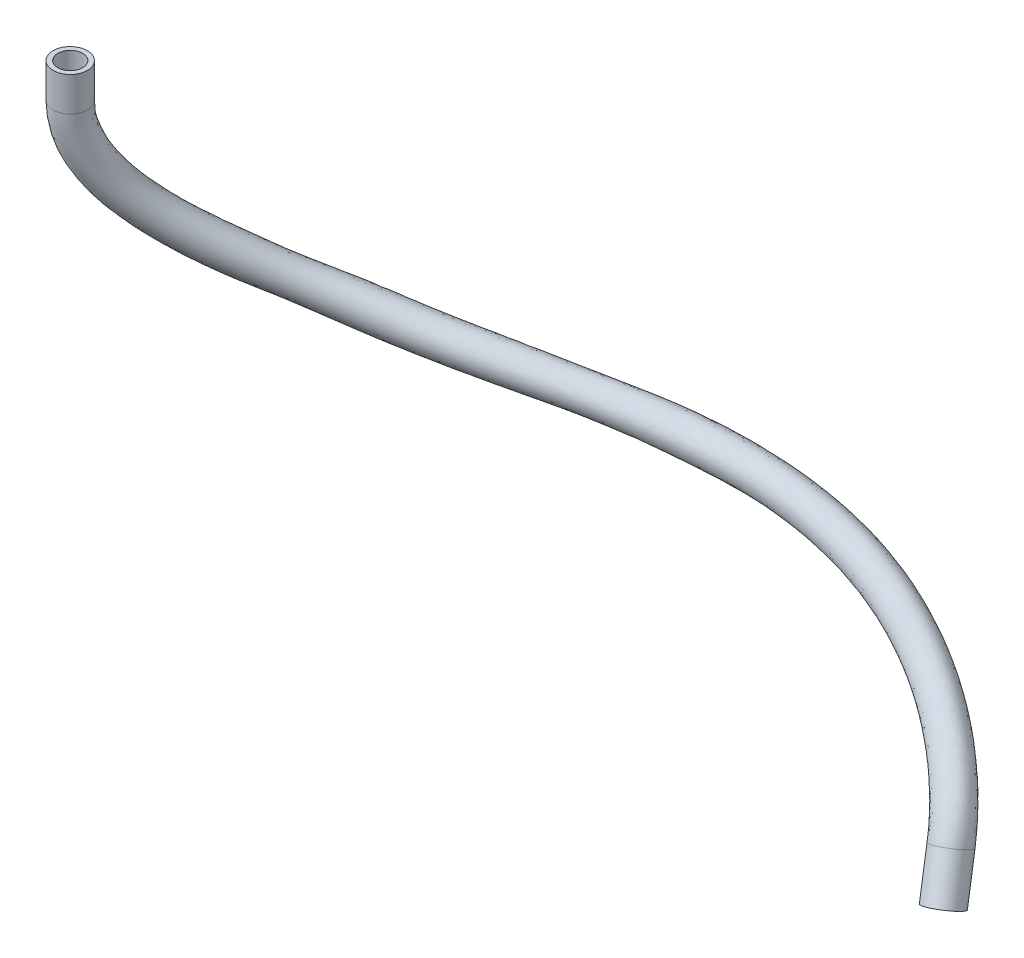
ISO-10303-21;
HEADER;
FILE_DESCRIPTION(('STEP AP214'),'2;1');
FILE_NAME('part.step','',(''),(''),'','','');
FILE_SCHEMA(('AUTOMOTIVE_DESIGN { 1 0 10303 214 1 1 1 1 }'));
ENDSEC;
DATA;
#1=APPLICATION_CONTEXT('core data for automotive mechanical design processes');
#2=APPLICATION_PROTOCOL_DEFINITION('international standard','automotive_design',2000,#1);
#3=PRODUCT_CONTEXT('',#1,'mechanical');
#4=PRODUCT('Part','Part','',(#3));
#5=PRODUCT_RELATED_PRODUCT_CATEGORY('part','',(#4));
#6=PRODUCT_DEFINITION_FORMATION('','',#4);
#7=PRODUCT_DEFINITION_CONTEXT('part definition',#1,'design');
#8=PRODUCT_DEFINITION('design','',#6,#7);
#9=PRODUCT_DEFINITION_SHAPE('','',#8);
#10=(LENGTH_UNIT() NAMED_UNIT(*) SI_UNIT(.MILLI.,.METRE.));
#11=(NAMED_UNIT(*) PLANE_ANGLE_UNIT() SI_UNIT($,.RADIAN.));
#12=(NAMED_UNIT(*) SI_UNIT($,.STERADIAN.) SOLID_ANGLE_UNIT());
#13=UNCERTAINTY_MEASURE_WITH_UNIT(LENGTH_MEASURE(1.E-05),#10,'distance_accuracy_value','');
#14=(GEOMETRIC_REPRESENTATION_CONTEXT(3) GLOBAL_UNCERTAINTY_ASSIGNED_CONTEXT((#13)) GLOBAL_UNIT_ASSIGNED_CONTEXT((#10,
#11,#12)) REPRESENTATION_CONTEXT('',''));
#15=CARTESIAN_POINT('',(0.,0.,0.));
#16=DIRECTION('',(0.,0.,1.));
#17=DIRECTION('',(1.,0.,0.));
#18=AXIS2_PLACEMENT_3D('',#15,#16,#17);
#19=CARTESIAN_POINT('',(148.914995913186,-93.9022089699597,-18.4763685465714));
#20=DIRECTION('',(0.240157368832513,-0.878268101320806,0.413484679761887));
#21=DIRECTION('',(0.,-0.425950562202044,-0.904746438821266));
#22=AXIS2_PLACEMENT_3D('',#19,#20,#21);
#23=CYLINDRICAL_SURFACE('',#22,2.75);
#24=CARTESIAN_POINT('',(148.914995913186,-93.9022089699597,-18.4763685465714));
#25=DIRECTION('',(0.240157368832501,-0.878268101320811,0.413484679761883));
#26=DIRECTION('',(-0.0483571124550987,-0.43624560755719,-0.898527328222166));
#27=AXIS2_PLACEMENT_3D('',#24,#25,#26);
#28=CIRCLE('',#27,2.75);
#29=CARTESIAN_POINT('',(148.914995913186,-95.0735730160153,-20.9644212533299));
#30=VERTEX_POINT('',#29);
#31=EDGE_CURVE('E96',#30,#30,#28,.T.);
#32=CARTESIAN_POINT('',(150.624157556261,-100.152702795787,-15.5336641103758));
#33=DIRECTION('',(0.240157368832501,-0.878268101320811,0.413484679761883));
#34=DIRECTION('',(-0.0483571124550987,-0.43624560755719,-0.898527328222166));
#35=AXIS2_PLACEMENT_3D('',#32,#33,#34);
#36=CIRCLE('',#35,2.75);
#37=CARTESIAN_POINT('',(150.624157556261,-101.324066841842,-18.0217168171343));
#38=VERTEX_POINT('',#37);
#39=EDGE_CURVE('E11',#38,#38,#36,.T.);
#40=CARTESIAN_POINT('',(148.914995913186,-95.0735730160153,-20.9644212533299));
#41=CARTESIAN_POINT('',(148.932799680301,-95.138682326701,-20.9337680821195));
#42=CARTESIAN_POINT('',(148.950603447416,-95.2037916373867,-20.9031149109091));
#43=CARTESIAN_POINT('',(148.986210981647,-95.3340102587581,-20.8418085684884));
#44=CARTESIAN_POINT('',(149.004014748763,-95.3991195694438,-20.811155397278));
#45=CARTESIAN_POINT('',(149.039622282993,-95.5293381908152,-20.7498490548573));
#46=CARTESIAN_POINT('',(149.057426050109,-95.5944475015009,-20.7191958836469));
#47=CARTESIAN_POINT('',(149.093033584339,-95.7246661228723,-20.6578895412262));
#48=CARTESIAN_POINT('',(149.110837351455,-95.789775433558,-20.6272363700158));
#49=CARTESIAN_POINT('',(149.146444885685,-95.9199940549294,-20.5659300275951));
#50=CARTESIAN_POINT('',(149.164248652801,-95.9851033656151,-20.5352768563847));
#51=CARTESIAN_POINT('',(149.199856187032,-96.1153219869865,-20.4739705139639));
#52=CARTESIAN_POINT('',(149.217659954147,-96.1804312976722,-20.4433173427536));
#53=CARTESIAN_POINT('',(149.253267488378,-96.3106499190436,-20.3820110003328));
#54=CARTESIAN_POINT('',(149.271071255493,-96.3757592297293,-20.3513578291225));
#55=CARTESIAN_POINT('',(149.306678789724,-96.5059778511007,-20.2900514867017));
#56=CARTESIAN_POINT('',(149.324482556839,-96.5710871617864,-20.2593983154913));
#57=CARTESIAN_POINT('',(149.36009009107,-96.7013057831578,-20.1980919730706));
#58=CARTESIAN_POINT('',(149.377893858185,-96.7664150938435,-20.1674388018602));
#59=CARTESIAN_POINT('',(149.413501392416,-96.8966337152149,-20.1061324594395));
#60=CARTESIAN_POINT('',(149.431305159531,-96.9617430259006,-20.0754792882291));
#61=CARTESIAN_POINT('',(149.466912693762,-97.091961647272,-20.0141729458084));
#62=CARTESIAN_POINT('',(149.484716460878,-97.1570709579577,-19.983519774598));
#63=CARTESIAN_POINT('',(149.520323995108,-97.2872895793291,-19.9222134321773));
#64=CARTESIAN_POINT('',(149.538127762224,-97.3523988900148,-19.8915602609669));
#65=CARTESIAN_POINT('',(149.573735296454,-97.4826175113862,-19.8302539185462));
#66=CARTESIAN_POINT('',(149.59153906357,-97.5477268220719,-19.7996007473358));
#67=CARTESIAN_POINT('',(149.627146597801,-97.6779454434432,-19.7382944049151));
#68=CARTESIAN_POINT('',(149.644950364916,-97.743054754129,-19.7076412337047));
#69=CARTESIAN_POINT('',(149.680557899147,-97.8732733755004,-19.6463348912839));
#70=CARTESIAN_POINT('',(149.698361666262,-97.9383826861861,-19.6156817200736));
#71=CARTESIAN_POINT('',(149.733969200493,-98.0686013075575,-19.5543753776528));
#72=CARTESIAN_POINT('',(149.751772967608,-98.1337106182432,-19.5237222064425));
#73=CARTESIAN_POINT('',(149.787380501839,-98.2639292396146,-19.4624158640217));
#74=CARTESIAN_POINT('',(149.805184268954,-98.3290385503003,-19.4317626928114));
#75=CARTESIAN_POINT('',(149.840791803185,-98.4592571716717,-19.3704563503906));
#76=CARTESIAN_POINT('',(149.8585955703,-98.5243664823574,-19.3398031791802));
#77=CARTESIAN_POINT('',(149.894203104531,-98.6545851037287,-19.2784968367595));
#78=CARTESIAN_POINT('',(149.912006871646,-98.7196944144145,-19.2478436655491));
#79=CARTESIAN_POINT('',(149.947614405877,-98.8499130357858,-19.1865373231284));
#80=CARTESIAN_POINT('',(149.965418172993,-98.9150223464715,-19.155884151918));
#81=CARTESIAN_POINT('',(150.001025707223,-99.0452409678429,-19.0945778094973));
#82=CARTESIAN_POINT('',(150.018829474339,-99.1103502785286,-19.0639246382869));
#83=CARTESIAN_POINT('',(150.054437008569,-99.2405688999,-19.0026182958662));
#84=CARTESIAN_POINT('',(150.072240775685,-99.3056782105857,-18.9719651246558));
#85=CARTESIAN_POINT('',(150.107848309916,-99.4358968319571,-18.9106587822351));
#86=CARTESIAN_POINT('',(150.125652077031,-99.5010061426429,-18.8800056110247));
#87=CARTESIAN_POINT('',(150.161259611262,-99.6312247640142,-18.8186992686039));
#88=CARTESIAN_POINT('',(150.179063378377,-99.6963340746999,-18.7880460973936));
#89=CARTESIAN_POINT('',(150.214670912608,-99.8265526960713,-18.7267397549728));
#90=CARTESIAN_POINT('',(150.232474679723,-99.891662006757,-18.6960865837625));
#91=CARTESIAN_POINT('',(150.268082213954,-100.021880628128,-18.6347802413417));
#92=CARTESIAN_POINT('',(150.285885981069,-100.086989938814,-18.6041270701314));
#93=CARTESIAN_POINT('',(150.3214935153,-100.217208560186,-18.5428207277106));
#94=CARTESIAN_POINT('',(150.339297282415,-100.282317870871,-18.5121675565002));
#95=CARTESIAN_POINT('',(150.374904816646,-100.412536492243,-18.4508612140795));
#96=CARTESIAN_POINT('',(150.392708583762,-100.477645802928,-18.4202080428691));
#97=CARTESIAN_POINT('',(150.428316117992,-100.6078644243,-18.3589017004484));
#98=CARTESIAN_POINT('',(150.446119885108,-100.672973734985,-18.328248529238));
#99=CARTESIAN_POINT('',(150.481727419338,-100.803192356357,-18.2669421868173));
#100=CARTESIAN_POINT('',(150.499531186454,-100.868301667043,-18.2362890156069));
#101=CARTESIAN_POINT('',(150.535138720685,-100.998520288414,-18.1749826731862));
#102=CARTESIAN_POINT('',(150.5529424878,-101.0636295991,-18.1443295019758));
#103=CARTESIAN_POINT('',(150.588550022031,-101.193848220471,-18.0830231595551));
#104=CARTESIAN_POINT('',(150.606353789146,-101.258957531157,-18.0523699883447));
#105=CARTESIAN_POINT('',(150.624157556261,-101.324066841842,-18.0217168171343));
#106=B_SPLINE_CURVE_WITH_KNOTS('',3,(#40,#41,#42,#43,#44,#45,#46,#47,#48,#49,#50,#51,#52,#53,
#54,#55,#56,#57,#58,#59,#60,#61,#62,#63,#64,#65,#66,#67,#68,#69,#70,#71,#72,#73,#74,#75,#76,#77,
#78,#79,#80,#81,#82,#83,#84,#85,#86,#87,#88,#89,#90,#91,#92,#93,#94,#95,#96,#97,#98,#99,#100,
#101,#102,#103,#104,#105),.UNSPECIFIED.,.F.,.F.,(4,2,2,2,2,2,2,2,2,2,2,2,2,2,2,2,2,2,2,2,2,2,2,
2,2,2,2,2,2,2,2,2,4),(0.,0.222401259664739,0.444802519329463,0.66720377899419,0.889605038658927,
1.11200629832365,1.33440755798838,1.5568088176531,1.77921007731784,2.00161133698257,
2.22401259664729,2.44641385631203,2.66881511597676,2.89121637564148,3.11361763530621,
3.33601889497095,3.55842015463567,3.7808214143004,4.00322267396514,4.22562393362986,
4.44802519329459,4.67042645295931,4.89282771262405,5.11522897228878,5.3376302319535,
5.56003149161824,5.78243275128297,6.00483401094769,6.22723527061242,6.44963653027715,
6.67203778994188,6.89443904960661,7.11684030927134),.UNSPECIFIED.);
#107=EDGE_CURVE('BSEAM73',#30,#38,#106,.T.);
#108=ORIENTED_EDGE('',*,*,#31,.T.);
#109=ORIENTED_EDGE('',*,*,#39,.F.);
#110=ORIENTED_EDGE('',*,*,#107,.T.);
#111=ORIENTED_EDGE('',*,*,#107,.F.);
#112=EDGE_LOOP('',(#108,#110,#109,#111));
#113=FACE_BOUND('',#112,.T.);
#114=ADVANCED_FACE('F73',(#113),#23,.T.);
#115=CARTESIAN_POINT('',(148.914995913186,-93.9022089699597,-18.4763685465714));
#116=DIRECTION('',(0.240157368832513,-0.878268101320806,0.413484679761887));
#117=DIRECTION('',(0.,-0.425950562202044,-0.904746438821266));
#118=AXIS2_PLACEMENT_3D('',#115,#116,#117);
#119=CYLINDRICAL_SURFACE('',#118,2.);
#120=CARTESIAN_POINT('',(148.914995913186,-93.9022089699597,-18.4763685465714));
#121=DIRECTION('',(0.240157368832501,-0.878268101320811,0.413484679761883));
#122=DIRECTION('',(-0.0483571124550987,-0.43624560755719,-0.898527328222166));
#123=AXIS2_PLACEMENT_3D('',#120,#121,#122);
#124=CIRCLE('',#123,2.);
#125=CARTESIAN_POINT('',(148.914995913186,-94.7541100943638,-20.2858614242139));
#126=VERTEX_POINT('',#125);
#127=EDGE_CURVE('E99',#126,#126,#124,.T.);
#128=CARTESIAN_POINT('',(150.624157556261,-100.152702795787,-15.5336641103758));
#129=DIRECTION('',(0.240157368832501,-0.878268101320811,0.413484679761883));
#130=DIRECTION('',(-0.0483571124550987,-0.43624560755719,-0.898527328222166));
#131=AXIS2_PLACEMENT_3D('',#128,#129,#130);
#132=CIRCLE('',#131,2.);
#133=CARTESIAN_POINT('',(150.624157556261,-101.004603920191,-17.3431569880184));
#134=VERTEX_POINT('',#133);
#135=EDGE_CURVE('E79',#134,#134,#132,.T.);
#136=CARTESIAN_POINT('',(148.914995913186,-94.7541100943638,-20.2858614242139));
#137=CARTESIAN_POINT('',(148.932799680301,-94.8192194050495,-20.2552082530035));
#138=CARTESIAN_POINT('',(148.950603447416,-94.8843287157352,-20.2245550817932));
#139=CARTESIAN_POINT('',(148.986210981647,-95.0145473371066,-20.1632487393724));
#140=CARTESIAN_POINT('',(149.004014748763,-95.0796566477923,-20.1325955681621));
#141=CARTESIAN_POINT('',(149.039622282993,-95.2098752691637,-20.0712892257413));
#142=CARTESIAN_POINT('',(149.057426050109,-95.2749845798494,-20.0406360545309));
#143=CARTESIAN_POINT('',(149.093033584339,-95.4052032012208,-19.9793297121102));
#144=CARTESIAN_POINT('',(149.110837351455,-95.4703125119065,-19.9486765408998));
#145=CARTESIAN_POINT('',(149.146444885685,-95.6005311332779,-19.8873701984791));
#146=CARTESIAN_POINT('',(149.164248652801,-95.6656404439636,-19.8567170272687));
#147=CARTESIAN_POINT('',(149.199856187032,-95.795859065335,-19.795410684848));
#148=CARTESIAN_POINT('',(149.217659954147,-95.8609683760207,-19.7647575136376));
#149=CARTESIAN_POINT('',(149.253267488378,-95.991186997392,-19.7034511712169));
#150=CARTESIAN_POINT('',(149.271071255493,-96.0562963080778,-19.6727980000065));
#151=CARTESIAN_POINT('',(149.306678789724,-96.1865149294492,-19.6114916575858));
#152=CARTESIAN_POINT('',(149.324482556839,-96.2516242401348,-19.5808384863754));
#153=CARTESIAN_POINT('',(149.36009009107,-96.3818428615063,-19.5195321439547));
#154=CARTESIAN_POINT('',(149.377893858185,-96.446952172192,-19.4888789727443));
#155=CARTESIAN_POINT('',(149.413501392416,-96.5771707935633,-19.4275726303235));
#156=CARTESIAN_POINT('',(149.431305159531,-96.6422801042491,-19.3969194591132));
#157=CARTESIAN_POINT('',(149.466912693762,-96.7724987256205,-19.3356131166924));
#158=CARTESIAN_POINT('',(149.484716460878,-96.8376080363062,-19.3049599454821));
#159=CARTESIAN_POINT('',(149.520323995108,-96.9678266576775,-19.2436536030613));
#160=CARTESIAN_POINT('',(149.538127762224,-97.0329359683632,-19.213000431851));
#161=CARTESIAN_POINT('',(149.573735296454,-97.1631545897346,-19.1516940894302));
#162=CARTESIAN_POINT('',(149.59153906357,-97.2282639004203,-19.1210409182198));
#163=CARTESIAN_POINT('',(149.627146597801,-97.3584825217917,-19.0597345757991));
#164=CARTESIAN_POINT('',(149.644950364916,-97.4235918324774,-19.0290814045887));
#165=CARTESIAN_POINT('',(149.680557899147,-97.5538104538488,-18.967775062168));
#166=CARTESIAN_POINT('',(149.698361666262,-97.6189197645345,-18.9371218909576));
#167=CARTESIAN_POINT('',(149.733969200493,-97.7491383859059,-18.8758155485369));
#168=CARTESIAN_POINT('',(149.751772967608,-97.8142476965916,-18.8451623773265));
#169=CARTESIAN_POINT('',(149.787380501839,-97.944466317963,-18.7838560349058));
#170=CARTESIAN_POINT('',(149.805184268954,-98.0095756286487,-18.7532028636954));
#171=CARTESIAN_POINT('',(149.840791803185,-98.1397942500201,-18.6918965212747));
#172=CARTESIAN_POINT('',(149.8585955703,-98.2049035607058,-18.6612433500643));
#173=CARTESIAN_POINT('',(149.894203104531,-98.3351221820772,-18.5999370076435));
#174=CARTESIAN_POINT('',(149.912006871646,-98.4002314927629,-18.5692838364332));
#175=CARTESIAN_POINT('',(149.947614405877,-98.5304501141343,-18.5079774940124));
#176=CARTESIAN_POINT('',(149.965418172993,-98.59555942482,-18.4773243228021));
#177=CARTESIAN_POINT('',(150.001025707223,-98.7257780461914,-18.4160179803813));
#178=CARTESIAN_POINT('',(150.018829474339,-98.7908873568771,-18.385364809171));
#179=CARTESIAN_POINT('',(150.054437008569,-98.9211059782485,-18.3240584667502));
#180=CARTESIAN_POINT('',(150.072240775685,-98.9862152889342,-18.2934052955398));
#181=CARTESIAN_POINT('',(150.107848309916,-99.1164339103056,-18.2320989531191));
#182=CARTESIAN_POINT('',(150.125652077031,-99.1815432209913,-18.2014457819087));
#183=CARTESIAN_POINT('',(150.161259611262,-99.3117618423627,-18.140139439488));
#184=CARTESIAN_POINT('',(150.179063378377,-99.3768711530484,-18.1094862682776));
#185=CARTESIAN_POINT('',(150.214670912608,-99.5070897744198,-18.0481799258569));
#186=CARTESIAN_POINT('',(150.232474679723,-99.5721990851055,-18.0175267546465));
#187=CARTESIAN_POINT('',(150.268082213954,-99.7024177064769,-17.9562204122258));
#188=CARTESIAN_POINT('',(150.285885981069,-99.7675270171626,-17.9255672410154));
#189=CARTESIAN_POINT('',(150.3214935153,-99.897745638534,-17.8642608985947));
#190=CARTESIAN_POINT('',(150.339297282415,-99.9628549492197,-17.8336077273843));
#191=CARTESIAN_POINT('',(150.374904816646,-100.093073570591,-17.7723013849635));
#192=CARTESIAN_POINT('',(150.392708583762,-100.158182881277,-17.7416482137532));
#193=CARTESIAN_POINT('',(150.428316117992,-100.288401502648,-17.6803418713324));
#194=CARTESIAN_POINT('',(150.446119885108,-100.353510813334,-17.6496887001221));
#195=CARTESIAN_POINT('',(150.481727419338,-100.483729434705,-17.5883823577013));
#196=CARTESIAN_POINT('',(150.499531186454,-100.548838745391,-17.557729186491));
#197=CARTESIAN_POINT('',(150.535138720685,-100.679057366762,-17.4964228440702));
#198=CARTESIAN_POINT('',(150.5529424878,-100.744166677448,-17.4657696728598));
#199=CARTESIAN_POINT('',(150.588550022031,-100.874385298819,-17.4044633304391));
#200=CARTESIAN_POINT('',(150.606353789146,-100.939494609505,-17.3738101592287));
#201=CARTESIAN_POINT('',(150.624157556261,-101.004603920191,-17.3431569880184));
#202=B_SPLINE_CURVE_WITH_KNOTS('',3,(#136,#137,#138,#139,#140,#141,#142,#143,#144,#145,#146,
#147,#148,#149,#150,#151,#152,#153,#154,#155,#156,#157,#158,#159,#160,#161,#162,#163,#164,#165,
#166,#167,#168,#169,#170,#171,#172,#173,#174,#175,#176,#177,#178,#179,#180,#181,#182,#183,#184,
#185,#186,#187,#188,#189,#190,#191,#192,#193,#194,#195,#196,#197,#198,#199,#200,#201),
.UNSPECIFIED.,.F.,.F.,(4,2,2,2,2,2,2,2,2,2,2,2,2,2,2,2,2,2,2,2,2,2,2,2,2,2,2,2,2,2,2,2,4),(0.,
0.222401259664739,0.444802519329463,0.66720377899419,0.889605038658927,1.11200629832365,
1.33440755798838,1.5568088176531,1.77921007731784,2.00161133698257,2.22401259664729,
2.44641385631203,2.66881511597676,2.89121637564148,3.11361763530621,3.33601889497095,
3.55842015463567,3.7808214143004,4.00322267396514,4.22562393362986,4.44802519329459,
4.67042645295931,4.89282771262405,5.11522897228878,5.3376302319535,5.56003149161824,
5.78243275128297,6.00483401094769,6.22723527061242,6.44963653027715,6.67203778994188,
6.89443904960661,7.11684030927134),.UNSPECIFIED.);
#203=EDGE_CURVE('BSEAM115',#126,#134,#202,.T.);
#204=ORIENTED_EDGE('',*,*,#127,.F.);
#205=ORIENTED_EDGE('',*,*,#135,.T.);
#206=ORIENTED_EDGE('',*,*,#203,.T.);
#207=ORIENTED_EDGE('',*,*,#203,.F.);
#208=EDGE_LOOP('',(#204,#206,#205,#207));
#209=FACE_BOUND('',#208,.T.);
#210=ADVANCED_FACE('F115',(#209),#119,.F.);
#211=CARTESIAN_POINT('',(26.,-42.4999957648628,0.));
#212=DIRECTION('',(0.,1.,0.));
#213=DIRECTION('',(-1.,0.,0.));
#214=AXIS2_PLACEMENT_3D('',#211,#212,#213);
#215=CYLINDRICAL_SURFACE('',#214,2.);
#216=CARTESIAN_POINT('',(26.,-42.4999957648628,0.));
#217=DIRECTION('',(0.,-1.,0.));
#218=DIRECTION('',(1.,0.,0.));
#219=AXIS2_PLACEMENT_3D('',#216,#217,#218);
#220=CIRCLE('',#219,2.);
#221=CARTESIAN_POINT('',(28.,-42.4999957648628,0.));
#222=VERTEX_POINT('',#221);
#223=EDGE_CURVE('E94',#222,#222,#220,.T.);
#224=ORIENTED_EDGE('',*,*,#223,.T.);
#225=EDGE_LOOP('',(#224));
#226=FACE_BOUND('',#225,.T.);
#227=CARTESIAN_POINT('',(26.,-36.999994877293,0.));
#228=DIRECTION('',(0.,-1.,0.));
#229=DIRECTION('',(1.,0.,0.));
#230=AXIS2_PLACEMENT_3D('',#227,#228,#229);
#231=CIRCLE('',#230,2.);
#232=CARTESIAN_POINT('',(28.,-36.999994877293,0.));
#233=VERTEX_POINT('',#232);
#234=EDGE_CURVE('E92',#233,#233,#231,.T.);
#235=ORIENTED_EDGE('',*,*,#234,.F.);
#236=EDGE_LOOP('',(#235));
#237=FACE_BOUND('',#236,.T.);
#238=ADVANCED_FACE('F105',(#226,#237),#215,.F.);
#239=CARTESIAN_POINT('',(26.,-42.4999957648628,0.));
#240=DIRECTION('',(0.,1.,0.));
#241=DIRECTION('',(-1.,0.,0.));
#242=AXIS2_PLACEMENT_3D('',#239,#240,#241);
#243=CYLINDRICAL_SURFACE('',#242,2.75);
#244=CARTESIAN_POINT('',(26.,-42.4999957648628,0.));
#245=DIRECTION('',(0.,-1.,0.));
#246=DIRECTION('',(1.,0.,0.));
#247=AXIS2_PLACEMENT_3D('',#244,#245,#246);
#248=CIRCLE('',#247,2.75);
#249=CARTESIAN_POINT('',(28.75,-42.4999957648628,0.));
#250=VERTEX_POINT('',#249);
#251=EDGE_CURVE('E83',#250,#250,#248,.T.);
#252=ORIENTED_EDGE('',*,*,#251,.F.);
#253=EDGE_LOOP('',(#252));
#254=FACE_BOUND('',#253,.T.);
#255=CARTESIAN_POINT('',(26.,-36.999994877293,0.));
#256=DIRECTION('',(0.,-1.,0.));
#257=DIRECTION('',(1.,0.,0.));
#258=AXIS2_PLACEMENT_3D('',#255,#256,#257);
#259=CIRCLE('',#258,2.75);
#260=CARTESIAN_POINT('',(28.75,-36.999994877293,0.));
#261=VERTEX_POINT('',#260);
#262=EDGE_CURVE('E87',#261,#261,#259,.T.);
#263=ORIENTED_EDGE('',*,*,#262,.T.);
#264=EDGE_LOOP('',(#263));
#265=FACE_BOUND('',#264,.T.);
#266=ADVANCED_FACE('F121',(#254,#265),#243,.T.);
#267=CARTESIAN_POINT('',(26.,-36.999994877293,0.));
#268=DIRECTION('',(0.,-1.,0.));
#269=DIRECTION('',(1.,0.,0.));
#270=AXIS2_PLACEMENT_3D('',#267,#268,#269);
#271=PLANE('',#270);
#272=ORIENTED_EDGE('',*,*,#234,.T.);
#273=EDGE_LOOP('',(#272));
#274=FACE_BOUND('',#273,.T.);
#275=ORIENTED_EDGE('',*,*,#262,.F.);
#276=EDGE_LOOP('',(#275));
#277=FACE_BOUND('',#276,.T.);
#278=ADVANCED_FACE('F127',(#274,#277),#271,.F.);
#279=CARTESIAN_POINT('',(150.624157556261,-100.152702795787,-15.5336641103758));
#280=DIRECTION('',(0.240157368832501,-0.878268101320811,0.413484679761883));
#281=DIRECTION('',(-0.0483571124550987,-0.43624560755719,-0.898527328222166));
#282=AXIS2_PLACEMENT_3D('',#279,#280,#281);
#283=PLANE('',#282);
#284=ORIENTED_EDGE('',*,*,#135,.F.);
#285=EDGE_LOOP('',(#284));
#286=FACE_BOUND('',#285,.T.);
#287=ORIENTED_EDGE('',*,*,#39,.T.);
#288=EDGE_LOOP('',(#287));
#289=FACE_BOUND('',#288,.T.);
#290=ADVANCED_FACE('F131',(#286,#289),#283,.T.);
#291=CARTESIAN_POINT('',(28.75,-42.4999957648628,0.));
#292=CARTESIAN_POINT('',(28.75,-43.7765438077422,0.));
#293=CARTESIAN_POINT('',(28.9352645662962,-45.7354849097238,-0.170747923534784));
#294=CARTESIAN_POINT('',(29.7310391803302,-48.9900951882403,-1.09436596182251));
#295=CARTESIAN_POINT('',(31.0202255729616,-52.0434531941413,-2.54956545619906));
#296=CARTESIAN_POINT('',(32.763046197,-55.0259343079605,-4.4509762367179));
#297=CARTESIAN_POINT('',(35.9509557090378,-59.3269919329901,-7.8071546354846));
#298=CARTESIAN_POINT('',(41.3967733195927,-64.7135614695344,-12.8287855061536));
#299=CARTESIAN_POINT('',(45.9882365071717,-69.2448468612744,-17.4180763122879));
#300=CARTESIAN_POINT('',(51.0763572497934,-72.3779052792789,-21.2929369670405));
#301=CARTESIAN_POINT('',(56.2786946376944,-73.9555459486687,-24.155224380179));
#302=CARTESIAN_POINT('',(67.9719591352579,-75.6612876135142,-29.7866336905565));
#303=CARTESIAN_POINT('',(81.0049746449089,-79.3965853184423,-35.3194808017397));
#304=CARTESIAN_POINT('',(94.2233832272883,-80.2735524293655,-37.4974093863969));
#305=CARTESIAN_POINT('',(103.790336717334,-81.0693937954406,-37.7597690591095));
#306=CARTESIAN_POINT('',(109.589321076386,-81.617930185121,-37.2788331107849));
#307=CARTESIAN_POINT('',(117.447407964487,-82.493511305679,-35.9927433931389));
#308=CARTESIAN_POINT('',(125.222518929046,-83.5790363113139,-33.9649484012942));
#309=CARTESIAN_POINT('',(134.235543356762,-85.5002280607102,-30.6165303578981));
#310=CARTESIAN_POINT('',(140.236293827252,-87.4588067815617,-27.5884699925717));
#311=CARTESIAN_POINT('',(143.980857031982,-89.4255156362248,-25.2029117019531));
#312=CARTESIAN_POINT('',(146.217357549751,-91.0824695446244,-23.5454284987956));
#313=CARTESIAN_POINT('',(147.844284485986,-93.05202188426,-22.0436249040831));
#314=CARTESIAN_POINT('',(148.543197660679,-94.2285210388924,-21.3584942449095));
#315=CARTESIAN_POINT('',(148.782013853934,-95.1018843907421,-20.9473186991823));
#316=CARTESIAN_POINT('',(28.75,-42.4999957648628,-5.49999999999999));
#317=CARTESIAN_POINT('',(28.75,-44.218909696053,-5.49999999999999));
#318=CARTESIAN_POINT('',(29.0008669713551,-44.1791453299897,-5.58242723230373));
#319=CARTESIAN_POINT('',(29.6859951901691,-46.9667238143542,-6.19327835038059));
#320=CARTESIAN_POINT('',(30.9034523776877,-49.1735577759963,-7.27423746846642));
#321=CARTESIAN_POINT('',(32.6657099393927,-51.6319915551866,-8.79280866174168));
#322=CARTESIAN_POINT('',(36.0897364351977,-55.2392896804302,-11.5162648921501));
#323=CARTESIAN_POINT('',(42.6908702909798,-59.5074784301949,-15.5069213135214));
#324=CARTESIAN_POINT('',(48.6753456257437,-64.5629775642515,-17.2225621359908));
#325=CARTESIAN_POINT('',(54.0999734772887,-67.7520301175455,-19.9043706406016));
#326=CARTESIAN_POINT('',(58.6148348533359,-68.9432500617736,-23.2395708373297));
#327=CARTESIAN_POINT('',(68.3990962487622,-69.9450329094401,-30.3689470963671));
#328=CARTESIAN_POINT('',(82.5508743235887,-75.2070884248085,-31.4861463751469));
#329=CARTESIAN_POINT('',(94.7790076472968,-76.6796190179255,-33.311435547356));
#330=CARTESIAN_POINT('',(103.626694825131,-78.1391033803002,-33.1324729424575));
#331=CARTESIAN_POINT('',(108.987476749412,-79.1746558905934,-32.3736793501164));
#332=CARTESIAN_POINT('',(116.218448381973,-80.800621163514,-30.854240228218));
#333=CARTESIAN_POINT('',(123.321730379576,-82.7807385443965,-28.7778105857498));
#334=CARTESIAN_POINT('',(131.436363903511,-86.3172106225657,-25.8228985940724));
#335=CARTESIAN_POINT('',(136.763976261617,-89.3022165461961,-23.6836391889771));
#336=CARTESIAN_POINT('',(139.955742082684,-91.6613170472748,-22.1376326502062));
#337=CARTESIAN_POINT('',(141.703304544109,-93.2070512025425,-21.2557708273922));
#338=CARTESIAN_POINT('',(142.970625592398,-95.22742666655,-20.2756548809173));
#339=CARTESIAN_POINT('',(143.110021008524,-94.9368672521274,-20.7221800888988));
#340=CARTESIAN_POINT('',(143.449605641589,-96.1787460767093,-20.137509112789));
#341=CARTESIAN_POINT('',(23.25,-42.4999957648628,-5.49999999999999));
#342=CARTESIAN_POINT('',(23.25,-44.218909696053,-5.49999999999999));
#343=CARTESIAN_POINT('',(23.5551688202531,-45.2217901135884,-5.78497064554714));
#344=CARTESIAN_POINT('',(24.4311653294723,-48.50384112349,-6.76385218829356));
#345=CARTESIAN_POINT('',(25.868516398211,-51.16482773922,-8.3159762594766));
#346=CARTESIAN_POINT('',(27.829926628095,-53.7721235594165,-10.3466771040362));
#347=CARTESIAN_POINT('',(31.5411330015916,-57.2705418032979,-13.8809190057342));
#348=CARTESIAN_POINT('',(38.3322222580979,-60.4932562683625,-19.4956545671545));
#349=CARTESIAN_POINT('',(45.9897558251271,-62.8510330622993,-21.5875756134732));
#350=CARTESIAN_POINT('',(52.238551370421,-65.1298004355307,-24.6110017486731));
#351=CARTESIAN_POINT('',(56.7179938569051,-67.1574054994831,-28.2258113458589));
#352=CARTESIAN_POINT('',(65.9359885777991,-70.2994549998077,-35.4931567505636));
#353=CARTESIAN_POINT('',(81.9269017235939,-71.1638293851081,-35.7376109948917));
#354=CARTESIAN_POINT('',(94.7859578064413,-72.4919642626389,-36.9369295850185));
#355=CARTESIAN_POINT('',(104.11958917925,-73.5333921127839,-36.038858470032));
#356=CARTESIAN_POINT('',(109.749384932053,-74.2560862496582,-34.7386766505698));
#357=CARTESIAN_POINT('',(117.238178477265,-75.5568570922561,-32.3521167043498));
#358=CARTESIAN_POINT('',(124.453794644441,-77.3386100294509,-29.2196207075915));
#359=CARTESIAN_POINT('',(132.277964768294,-80.9500861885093,-24.4455735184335));
#360=CARTESIAN_POINT('',(137.223255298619,-84.4712809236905,-21.0155879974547));
#361=CARTESIAN_POINT('',(140.246499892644,-87.3678839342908,-18.6808561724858));
#362=CARTESIAN_POINT('',(141.948542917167,-89.4428183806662,-17.2469266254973));
#363=CARTESIAN_POINT('',(143.251681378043,-91.8957099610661,-15.8489429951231));
#364=CARTESIAN_POINT('',(143.375985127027,-92.5375164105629,-15.7802797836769));
#365=CARTESIAN_POINT('',(143.715569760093,-93.7793952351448,-15.1956088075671));
#366=CARTESIAN_POINT('',(23.25,-42.4999957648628,0.));
#367=CARTESIAN_POINT('',(23.25,-43.9977267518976,0.));
#368=CARTESIAN_POINT('',(23.4895664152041,-46.6754795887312,-0.373291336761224));
#369=CARTESIAN_POINT('',(24.4762093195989,-50.5547134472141,-1.66493979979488));
#370=CARTESIAN_POINT('',(25.985289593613,-54.0273694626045,-3.59130424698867));
#371=CARTESIAN_POINT('',(27.9272628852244,-57.1679801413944,-6.00484467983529));
#372=CARTESIAN_POINT('',(31.4023522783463,-61.3568347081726,-10.1718087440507));
#373=CARTESIAN_POINT('',(37.0381252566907,-65.6998331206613,-16.8175188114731));
#374=CARTESIAN_POINT('',(43.3026467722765,-67.5329938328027,-21.7830896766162));
#375=CARTESIAN_POINT('',(49.2149350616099,-69.7555599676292,-25.9995682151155));
#376=CARTESIAN_POINT('',(54.3818532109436,-72.1695791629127,-29.1414656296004));
#377=CARTESIAN_POINT('',(65.5088512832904,-76.0157835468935,-34.9108436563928));
#378=CARTESIAN_POINT('',(80.3810059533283,-75.353323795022,-39.5709386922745));
#379=CARTESIAN_POINT('',(94.2303266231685,-76.0858727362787,-41.1229150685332));
#380=CARTESIAN_POINT('',(104.283241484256,-76.463722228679,-40.6661366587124));
#381=CARTESIAN_POINT('',(110.351243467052,-76.6994126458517,-39.6438059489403));
#382=CARTESIAN_POINT('',(118.467107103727,-77.2496335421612,-37.490673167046));
#383=CARTESIAN_POINT('',(126.354499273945,-78.1366010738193,-34.406903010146));
#384=CARTESIAN_POINT('',(135.077462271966,-80.1342667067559,-29.2386576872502));
#385=CARTESIAN_POINT('',(140.694627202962,-82.6244128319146,-24.9220469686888));
#386=CARTESIAN_POINT('',(144.273253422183,-85.1380748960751,-21.7433140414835));
#387=CARTESIAN_POINT('',(146.456341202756,-87.2953628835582,-19.5473531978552));
#388=CARTESIAN_POINT('',(148.148720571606,-89.8058081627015,-17.5766585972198));
#389=CARTESIAN_POINT('',(148.758777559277,-91.6449124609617,-16.5033416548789));
#390=CARTESIAN_POINT('',(149.047977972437,-92.7025335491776,-16.0054183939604));
#391=CARTESIAN_POINT('',(23.25,-42.4999957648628,5.5));
#392=CARTESIAN_POINT('',(23.25,-43.7765438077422,5.5));
#393=CARTESIAN_POINT('',(23.423964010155,-48.129169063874,5.0383879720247));
#394=CARTESIAN_POINT('',(24.5212533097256,-52.6055857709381,3.43397258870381));
#395=CARTESIAN_POINT('',(26.1020627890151,-56.889911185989,1.13336776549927));
#396=CARTESIAN_POINT('',(28.0245991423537,-60.5638367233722,-1.66301225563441));
#397=CARTESIAN_POINT('',(31.2635715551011,-65.4431276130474,-6.46269848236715));
#398=CARTESIAN_POINT('',(35.7440282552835,-70.90640997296,-14.1393830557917));
#399=CARTESIAN_POINT('',(40.6155377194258,-72.2149546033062,-21.9786037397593));
#400=CARTESIAN_POINT('',(46.1913187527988,-74.3813194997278,-27.3881346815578));
#401=CARTESIAN_POINT('',(52.045712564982,-77.1817528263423,-30.0571199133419));
#402=CARTESIAN_POINT('',(65.0817139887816,-81.7321120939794,-34.3285305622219));
#403=CARTESIAN_POINT('',(78.8351101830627,-79.5428182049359,-43.4042663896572));
#404=CARTESIAN_POINT('',(93.6746954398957,-79.6797812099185,-45.3089005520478));
#405=CARTESIAN_POINT('',(104.446893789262,-79.394052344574,-45.2934148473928));
#406=CARTESIAN_POINT('',(110.953102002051,-79.1427390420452,-44.5489352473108));
#407=CARTESIAN_POINT('',(119.696035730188,-78.9424099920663,-42.6292296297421));
#408=CARTESIAN_POINT('',(128.255203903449,-78.9345921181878,-39.5941853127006));
#409=CARTESIAN_POINT('',(137.876959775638,-79.3184472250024,-34.0317418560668));
#410=CARTESIAN_POINT('',(144.165999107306,-80.7775447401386,-28.8285059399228));
#411=CARTESIAN_POINT('',(148.300006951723,-82.9082658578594,-24.8057719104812));
#412=CARTESIAN_POINT('',(150.964139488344,-85.1479073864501,-21.8477797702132));
#413=CARTESIAN_POINT('',(153.045759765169,-87.7159063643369,-19.3043741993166));
#414=CARTESIAN_POINT('',(154.141569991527,-90.7523085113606,-17.2264035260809));
#415=CARTESIAN_POINT('',(154.380386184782,-91.6256718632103,-16.8152279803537));
#416=CARTESIAN_POINT('',(28.75,-42.4999957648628,5.5));
#417=CARTESIAN_POINT('',(28.75,-43.3341779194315,5.5));
#418=CARTESIAN_POINT('',(28.8696621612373,-47.2918244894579,5.24093138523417));
#419=CARTESIAN_POINT('',(29.7760831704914,-51.0134665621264,4.00454642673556));
#420=CARTESIAN_POINT('',(31.1369987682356,-54.9133486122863,2.1751065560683));
#421=CARTESIAN_POINT('',(32.8603824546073,-58.4198770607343,-0.109143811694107));
#422=CARTESIAN_POINT('',(35.812174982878,-63.4146941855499,-4.09804437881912));
#423=CARTESIAN_POINT('',(40.1026763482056,-69.9196445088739,-10.1506496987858));
#424=CARTESIAN_POINT('',(43.3011273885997,-73.9267161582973,-17.613590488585));
#425=CARTESIAN_POINT('',(48.0527410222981,-77.0037804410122,-22.6815032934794));
#426=CARTESIAN_POINT('',(53.9425544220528,-78.9678418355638,-25.0708779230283));
#427=CARTESIAN_POINT('',(67.5448220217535,-81.3775423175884,-29.204320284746));
#428=CARTESIAN_POINT('',(79.4590749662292,-83.5860822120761,-39.1528152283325));
#429=CARTESIAN_POINT('',(93.6677588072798,-83.8674858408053,-41.6833832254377));
#430=CARTESIAN_POINT('',(103.953978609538,-83.999684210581,-42.3870651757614));
#431=CARTESIAN_POINT('',(110.191165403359,-84.0612044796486,-42.1839868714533));
#432=CARTESIAN_POINT('',(118.676367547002,-84.1864014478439,-41.1312465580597));
#433=CARTESIAN_POINT('',(127.123307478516,-84.3773340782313,-39.1520862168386));
#434=CARTESIAN_POINT('',(137.034722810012,-84.6832454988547,-35.4101621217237));
#435=CARTESIAN_POINT('',(143.708611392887,-85.6153970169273,-31.4933007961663));
#436=CARTESIAN_POINT('',(148.005971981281,-87.1897142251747,-28.2681907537));
#437=CARTESIAN_POINT('',(150.731410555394,-88.9578878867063,-25.835086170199));
#438=CARTESIAN_POINT('',(152.717943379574,-90.8766171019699,-23.8115949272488));
#439=CARTESIAN_POINT('',(153.976374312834,-93.5201748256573,-21.9948084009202));
#440=CARTESIAN_POINT('',(154.114422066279,-94.0250227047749,-21.7571282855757));
#441=CARTESIAN_POINT('',(28.75,-42.4999957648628,0.));
#442=CARTESIAN_POINT('',(28.75,-43.7765438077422,0.));
#443=CARTESIAN_POINT('',(28.9352645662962,-45.7354849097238,-0.170747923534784));
#444=CARTESIAN_POINT('',(29.7310391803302,-48.9900951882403,-1.09436596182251));
#445=CARTESIAN_POINT('',(31.0202255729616,-52.0434531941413,-2.54956545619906));
#446=CARTESIAN_POINT('',(32.763046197,-55.0259343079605,-4.4509762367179));
#447=CARTESIAN_POINT('',(35.9509557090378,-59.3269919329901,-7.8071546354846));
#448=CARTESIAN_POINT('',(41.3967733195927,-64.7135614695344,-12.8287855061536));
#449=CARTESIAN_POINT('',(45.9882365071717,-69.2448468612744,-17.4180763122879));
#450=CARTESIAN_POINT('',(51.0763572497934,-72.3779052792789,-21.2929369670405));
#451=CARTESIAN_POINT('',(56.2786946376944,-73.9555459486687,-24.155224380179));
#452=CARTESIAN_POINT('',(67.9719591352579,-75.6612876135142,-29.7866336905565));
#453=CARTESIAN_POINT('',(81.0049746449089,-79.3965853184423,-35.3194808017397));
#454=CARTESIAN_POINT('',(94.2233832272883,-80.2735524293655,-37.4974093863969));
#455=CARTESIAN_POINT('',(103.790336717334,-81.0693937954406,-37.7597690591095));
#456=CARTESIAN_POINT('',(109.589321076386,-81.617930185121,-37.2788331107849));
#457=CARTESIAN_POINT('',(117.447407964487,-82.493511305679,-35.9927433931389));
#458=CARTESIAN_POINT('',(125.222518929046,-83.5790363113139,-33.9649484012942));
#459=CARTESIAN_POINT('',(134.235543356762,-85.5002280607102,-30.6165303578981));
#460=CARTESIAN_POINT('',(140.236293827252,-87.4588067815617,-27.5884699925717));
#461=CARTESIAN_POINT('',(143.980857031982,-89.4255156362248,-25.2029117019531));
#462=CARTESIAN_POINT('',(146.217357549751,-91.0824695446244,-23.5454284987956));
#463=CARTESIAN_POINT('',(147.844284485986,-93.05202188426,-22.0436249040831));
#464=CARTESIAN_POINT('',(148.543197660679,-94.2285210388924,-21.3584942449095));
#465=CARTESIAN_POINT('',(148.782013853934,-95.1018843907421,-20.9473186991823));
#466=(BOUNDED_SURFACE() B_SPLINE_SURFACE(3,3,((#291,#292,#293,#294,#295,#296,#297,#298,#299,
#300,#301,#302,#303,#304,#305,#306,#307,#308,#309,#310,#311,#312,#313,#314,#315),(#316,#317,
#318,#319,#320,#321,#322,#323,#324,#325,#326,#327,#328,#329,#330,#331,#332,#333,#334,#335,#336,
#337,#338,#339,#340),(#341,#342,#343,#344,#345,#346,#347,#348,#349,#350,#351,#352,#353,#354,
#355,#356,#357,#358,#359,#360,#361,#362,#363,#364,#365),(#366,#367,#368,#369,#370,#371,#372,
#373,#374,#375,#376,#377,#378,#379,#380,#381,#382,#383,#384,#385,#386,#387,#388,#389,#390),
(#391,#392,#393,#394,#395,#396,#397,#398,#399,#400,#401,#402,#403,#404,#405,#406,#407,#408,#409,
#410,#411,#412,#413,#414,#415),(#416,#417,#418,#419,#420,#421,#422,#423,#424,#425,#426,#427,
#428,#429,#430,#431,#432,#433,#434,#435,#436,#437,#438,#439,#440),(#441,#442,#443,#444,#445,
#446,#447,#448,#449,#450,#451,#452,#453,#454,#455,#456,#457,#458,#459,#460,#461,#462,#463,#464,
#465)),.UNSPECIFIED.,.T.,.F.,.F.) B_SPLINE_SURFACE_WITH_KNOTS((4,3,4),(4,1,1,1,1,1,1,1,1,1,1,1,
1,1,1,1,1,1,1,1,1,1,4),(0.,0.5,1.),(0.,0.0250000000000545,0.05,0.075,0.100000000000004,0.125,
0.1875,0.25,0.254191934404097,0.318931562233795,0.375,0.5,0.583333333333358,0.610900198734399,
0.666666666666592,0.682656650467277,0.75,0.8125,0.875,0.906249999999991,0.9375,0.96875,1.),
.UNSPECIFIED.) GEOMETRIC_REPRESENTATION_ITEM() RATIONAL_B_SPLINE_SURFACE(((1.,1.,1.,1.,1.,1.,1.,
1.,1.,1.,1.,1.,1.,1.,1.,1.,1.,1.,1.,1.,1.,1.,1.,1.,1.),(0.333333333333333,0.333333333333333,
0.333333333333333,0.333333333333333,0.333333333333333,0.333333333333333,0.333333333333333,
0.333333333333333,0.333333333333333,0.333333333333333,0.333333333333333,0.333333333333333,
0.333333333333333,0.333333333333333,0.333333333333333,0.333333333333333,0.333333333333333,
0.333333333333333,0.333333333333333,0.333333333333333,0.333333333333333,0.333333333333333,
0.333333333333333,0.333333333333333,0.333333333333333),(0.333333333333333,0.333333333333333,
0.333333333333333,0.333333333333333,0.333333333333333,0.333333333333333,0.333333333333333,
0.333333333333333,0.333333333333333,0.333333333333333,0.333333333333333,0.333333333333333,
0.333333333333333,0.333333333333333,0.333333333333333,0.333333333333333,0.333333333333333,
0.333333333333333,0.333333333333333,0.333333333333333,0.333333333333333,0.333333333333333,
0.333333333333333,0.333333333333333,0.333333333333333),(1.,1.,1.,1.,1.,1.,1.,1.,1.,1.,1.,1.,1.,
1.,1.,1.,1.,1.,1.,1.,1.,1.,1.,1.,1.),(0.333333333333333,0.333333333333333,0.333333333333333,
0.333333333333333,0.333333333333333,0.333333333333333,0.333333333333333,0.333333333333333,
0.333333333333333,0.333333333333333,0.333333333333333,0.333333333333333,0.333333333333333,
0.333333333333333,0.333333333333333,0.333333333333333,0.333333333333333,0.333333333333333,
0.333333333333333,0.333333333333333,0.333333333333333,0.333333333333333,0.333333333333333,
0.333333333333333,0.333333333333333),(0.333333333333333,0.333333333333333,0.333333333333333,
0.333333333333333,0.333333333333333,0.333333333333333,0.333333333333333,0.333333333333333,
0.333333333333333,0.333333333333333,0.333333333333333,0.333333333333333,0.333333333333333,
0.333333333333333,0.333333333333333,0.333333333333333,0.333333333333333,0.333333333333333,
0.333333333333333,0.333333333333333,0.333333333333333,0.333333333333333,0.333333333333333,
0.333333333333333,0.333333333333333),(1.,1.,1.,1.,1.,1.,1.,1.,1.,1.,1.,1.,1.,1.,1.,1.,1.,1.,1.,
1.,1.,1.,1.,1.,1.))) REPRESENTATION_ITEM('') SURFACE());
#467=ORIENTED_EDGE('',*,*,#251,.T.);
#468=EDGE_LOOP('',(#467));
#469=FACE_BOUND('',#468,.T.);
#470=ORIENTED_EDGE('',*,*,#31,.F.);
#471=EDGE_LOOP('',(#470));
#472=FACE_BOUND('',#471,.T.);
#473=ADVANCED_FACE('F111',(#469,#472),#466,.F.);
#474=CARTESIAN_POINT('',(28.,-42.4999957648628,0.));
#475=CARTESIAN_POINT('',(28.,-43.776463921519,0.));
#476=CARTESIAN_POINT('',(28.1926693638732,-45.877700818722,-0.19836747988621));
#477=CARTESIAN_POINT('',(29.0144714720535,-49.1996921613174,-1.1721714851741));
#478=CARTESIAN_POINT('',(30.3336433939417,-52.3149926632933,-2.69162074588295));
#479=CARTESIAN_POINT('',(32.1036212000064,-55.3177697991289,-4.66286738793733));
#480=CARTESIAN_POINT('',(35.3306916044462,-59.6039813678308,-8.12960746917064));
#481=CARTESIAN_POINT('',(40.8024122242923,-64.8479855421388,-13.3727036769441));
#482=CARTESIAN_POINT('',(45.6220197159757,-69.0113998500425,-18.0133054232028));
#483=CARTESIAN_POINT('',(50.8225269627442,-72.0203285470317,-21.9347502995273));
#484=CARTESIAN_POINT('',(56.0200345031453,-73.7120217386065,-24.8351662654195));
#485=CARTESIAN_POINT('',(67.6360808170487,-75.7096178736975,-30.4853895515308));
#486=CARTESIAN_POINT('',(80.919887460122,-78.8452317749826,-35.8992259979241));
#487=CARTESIAN_POINT('',(94.2243309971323,-79.7025086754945,-37.9917949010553));
#488=CARTESIAN_POINT('',(103.857549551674,-80.4413421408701,-38.1560944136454));
#489=CARTESIAN_POINT('',(109.693217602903,-80.9472159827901,-37.6013328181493));
#490=CARTESIAN_POINT('',(117.586462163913,-81.7784529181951,-36.1969991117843));
#491=CARTESIAN_POINT('',(125.376891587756,-82.8369288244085,-34.0251947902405));
#492=CARTESIAN_POINT('',(134.350306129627,-84.7683438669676,-30.4287149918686));
#493=CARTESIAN_POINT('',(140.298925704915,-86.8000535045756,-27.2246398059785));
#494=CARTESIAN_POINT('',(144.020500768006,-88.8400289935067,-24.7315417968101));
#495=CARTESIAN_POINT('',(146.250818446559,-90.5692356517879,-22.9987346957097));
#496=CARTESIAN_POINT('',(147.882538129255,-92.5974330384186,-21.4401065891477));
#497=CARTESIAN_POINT('',(148.579620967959,-93.9019054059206,-20.6843310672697));
#498=CARTESIAN_POINT('',(148.818281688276,-94.7747001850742,-20.2734232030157));
#499=CARTESIAN_POINT('',(28.,-42.4999957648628,-3.99999999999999));
#500=CARTESIAN_POINT('',(28.,-44.0982051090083,-3.99999999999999));
#501=CARTESIAN_POINT('',(28.240380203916,-44.7458079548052,-4.13413424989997));
#502=CARTESIAN_POINT('',(28.9817122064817,-47.7281518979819,-4.88047140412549));
#503=CARTESIAN_POINT('',(30.2487174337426,-50.2277953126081,-6.12774584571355));
#504=CARTESIAN_POINT('',(32.0328311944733,-52.8494479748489,-7.82056369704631));
#505=CARTESIAN_POINT('',(35.4316230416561,-56.6311068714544,-10.8271422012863));
#506=CARTESIAN_POINT('',(41.7435736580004,-61.0617433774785,-15.3204388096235));
#507=CARTESIAN_POINT('',(47.5762808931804,-65.6064040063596,-17.871113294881));
#508=CARTESIAN_POINT('',(53.0215205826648,-68.6560556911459,-20.9248838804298));
#509=CARTESIAN_POINT('',(57.7190455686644,-70.0667156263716,-24.1692364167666));
#510=CARTESIAN_POINT('',(67.9467259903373,-71.5523417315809,-30.9088902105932));
#511=CARTESIAN_POINT('',(82.0441781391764,-75.7983249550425,-33.1113464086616));
#512=CARTESIAN_POINT('',(94.6284214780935,-77.0887388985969,-34.9474503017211));
#513=CARTESIAN_POINT('',(103.738537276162,-78.3102218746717,-34.7907881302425));
#514=CARTESIAN_POINT('',(109.255512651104,-79.1702892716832,-34.0339482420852));
#515=CARTESIAN_POINT('',(116.692673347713,-80.5472599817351,-32.4599059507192));
#516=CARTESIAN_POINT('',(123.994499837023,-82.2563483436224,-30.2527310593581));
#517=CARTESIAN_POINT('',(132.314539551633,-85.3625140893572,-26.9424368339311));
#518=CARTESIAN_POINT('',(137.773602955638,-88.1407119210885,-24.3847643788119));
#519=CARTESIAN_POINT('',(141.093145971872,-90.4660719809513,-22.5022453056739));
#520=CARTESIAN_POINT('',(142.967864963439,-92.1143645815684,-21.3335391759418));
#521=CARTESIAN_POINT('',(144.3380807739,-94.1796254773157,-20.1542726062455));
#522=CARTESIAN_POINT('',(144.628172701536,-94.4168941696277,-20.2216381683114));
#523=CARTESIAN_POINT('',(144.940166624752,-95.5578723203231,-19.6844707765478));
#524=CARTESIAN_POINT('',(24.,-42.4999957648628,-3.99999999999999));
#525=CARTESIAN_POINT('',(24.,-44.0982051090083,-3.99999999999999));
#526=CARTESIAN_POINT('',(24.27987245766,-45.5040950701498,-4.28143855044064));
#527=CARTESIAN_POINT('',(25.1600177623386,-48.8460553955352,-5.29543419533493));
#528=CARTESIAN_POINT('',(26.586945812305,-51.6759916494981,-6.88537405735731));
#529=CARTESIAN_POINT('',(28.5158978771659,-54.4059076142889,-8.95064983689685));
#530=CARTESIAN_POINT('',(32.1235478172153,-58.1083811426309,-12.5468906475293));
#531=CARTESIAN_POINT('',(38.5736478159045,-61.7786727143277,-18.2213357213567));
#532=CARTESIAN_POINT('',(45.6231246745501,-64.3613534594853,-21.0456685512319));
#533=CARTESIAN_POINT('',(51.6677590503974,-66.7489795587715,-24.3478883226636));
#534=CARTESIAN_POINT('',(56.3395248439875,-68.7679195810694,-27.7955931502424));
#535=CARTESIAN_POINT('',(66.1553749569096,-71.8101032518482,-34.635588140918));
#536=CARTESIAN_POINT('',(81.5903798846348,-72.8577729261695,-36.203320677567));
#537=CARTESIAN_POINT('',(94.6334761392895,-74.043171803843,-37.5841732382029));
#538=CARTESIAN_POINT('',(104.097005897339,-74.9606136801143,-36.9045230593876));
#539=CARTESIAN_POINT('',(109.809627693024,-75.5931477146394,-35.7539462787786));
#540=CARTESIAN_POINT('',(117.434295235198,-76.7336133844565,-33.5492706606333));
#541=CARTESIAN_POINT('',(124.817819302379,-78.2984366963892,-30.5740475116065));
#542=CARTESIAN_POINT('',(132.926612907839,-81.4591508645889,-25.94074586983));
#543=CARTESIAN_POINT('',(138.107624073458,-84.62730419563,-22.4443635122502));
#544=CARTESIAN_POINT('',(141.304606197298,-87.3435751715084,-19.98822604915));
#545=CARTESIAN_POINT('',(143.146220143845,-89.3767407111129,-18.4180161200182));
#546=CARTESIAN_POINT('',(144.542484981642,-91.7565587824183,-16.9348457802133));
#547=CARTESIAN_POINT('',(144.821601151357,-92.671911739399,-16.6275288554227));
#548=CARTESIAN_POINT('',(145.133595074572,-93.8128898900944,-16.0903614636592));
#549=CARTESIAN_POINT('',(24.,-42.4999957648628,0.));
#550=CARTESIAN_POINT('',(24.,-43.9373345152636,0.));
#551=CARTESIAN_POINT('',(24.2321616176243,-46.5613285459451,-0.34567178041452));
#552=CARTESIAN_POINT('',(25.1927770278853,-50.3375976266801,-1.58713427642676));
#553=CARTESIAN_POINT('',(26.6718717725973,-53.7578405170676,-3.4492489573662));
#554=CARTESIAN_POINT('',(28.5866878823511,-56.8756214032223,-5.79295352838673));
#555=CARTESIAN_POINT('',(32.0226163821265,-61.0802305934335,-9.84935591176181));
#556=CARTESIAN_POINT('',(37.6324863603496,-65.5652740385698,-16.2736006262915));
#557=CARTESIAN_POINT('',(43.6688635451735,-67.7664158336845,-21.1878605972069));
#558=CARTESIAN_POINT('',(49.4687653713,-70.113168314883,-25.3577548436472));
#559=CARTESIAN_POINT('',(54.6405134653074,-72.4131367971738,-28.461523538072));
#560=CARTESIAN_POINT('',(65.8447296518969,-75.9674331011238,-34.2120877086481));
#561=CARTESIAN_POINT('',(80.4660920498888,-75.9046779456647,-38.9911953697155));
#562=CARTESIAN_POINT('',(94.2293807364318,-76.6569234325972,-40.628526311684));
#563=CARTESIAN_POINT('',(104.216025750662,-77.0917628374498,-40.2698162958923));
#564=CARTESIAN_POINT('',(110.247342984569,-77.3701123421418,-39.3213130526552));
#565=CARTESIAN_POINT('',(118.328061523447,-77.9647235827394,-37.28640260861));
#566=CARTESIAN_POINT('',(126.200149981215,-78.8787939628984,-34.3466163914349));
#567=CARTESIAN_POINT('',(134.962610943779,-80.8658270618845,-29.4266255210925));
#568=CARTESIAN_POINT('',(140.632258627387,-83.284129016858,-25.2854238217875));
#569=CARTESIAN_POINT('',(144.233153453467,-85.7218930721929,-22.2154694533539));
#570=CARTESIAN_POINT('',(146.424621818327,-87.814965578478,-20.0910485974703));
#571=CARTESIAN_POINT('',(148.103957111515,-90.2365902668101,-18.1913850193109));
#572=CARTESIAN_POINT('',(148.73638281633,-92.022831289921,-17.1533515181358));
#573=CARTESIAN_POINT('',(149.011710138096,-93.0297177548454,-16.679313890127));
#574=CARTESIAN_POINT('',(24.,-42.4999957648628,4.));
#575=CARTESIAN_POINT('',(24.,-43.776463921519,4.));
#576=CARTESIAN_POINT('',(24.1844507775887,-47.6185620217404,3.5900949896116));
#577=CARTESIAN_POINT('',(25.225536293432,-51.829139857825,2.12116564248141));
#578=CARTESIAN_POINT('',(26.7567977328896,-55.8396893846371,-0.0131238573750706));
#579=CARTESIAN_POINT('',(28.6574778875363,-59.3453351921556,-2.63525721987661));
#580=CARTESIAN_POINT('',(31.9216849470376,-64.0520800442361,-7.15182117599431));
#581=CARTESIAN_POINT('',(36.6913249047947,-69.351875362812,-14.3258655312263));
#582=CARTESIAN_POINT('',(41.7146024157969,-71.1714782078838,-21.330052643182));
#583=CARTESIAN_POINT('',(47.2697716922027,-73.4773570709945,-26.3676213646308));
#584=CARTESIAN_POINT('',(52.9415020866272,-76.0583540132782,-29.1274539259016));
#585=CARTESIAN_POINT('',(65.5340843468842,-80.1247629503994,-33.7885872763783));
#586=CARTESIAN_POINT('',(79.3418042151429,-78.9515829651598,-41.7790700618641));
#587=CARTESIAN_POINT('',(93.825285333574,-79.2706750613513,-43.6728793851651));
#588=CARTESIAN_POINT('',(104.335045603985,-79.2229119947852,-43.6351095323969));
#589=CARTESIAN_POINT('',(110.685058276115,-79.1470769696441,-42.8886798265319));
#590=CARTESIAN_POINT('',(119.221827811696,-79.1958337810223,-41.0235345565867));
#591=CARTESIAN_POINT('',(127.582480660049,-79.4591512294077,-38.1191852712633));
#592=CARTESIAN_POINT('',(136.998608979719,-80.2725032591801,-32.912505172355));
#593=CARTESIAN_POINT('',(143.156893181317,-81.940953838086,-28.1264841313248));
#594=CARTESIAN_POINT('',(147.161700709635,-84.1002109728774,-24.4427128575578));
#595=CARTESIAN_POINT('',(149.703023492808,-86.253190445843,-21.7640810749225));
#596=CARTESIAN_POINT('',(151.665429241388,-88.7166217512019,-19.4479242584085));
#597=CARTESIAN_POINT('',(152.651164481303,-91.373750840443,-17.6791741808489));
#598=CARTESIAN_POINT('',(152.889825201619,-92.2465456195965,-17.2682663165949));
#599=CARTESIAN_POINT('',(28.,-42.4999957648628,4.));
#600=CARTESIAN_POINT('',(28.,-43.4547227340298,4.));
#601=CARTESIAN_POINT('',(28.1449585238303,-47.0095936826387,3.73739929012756));
#602=CARTESIAN_POINT('',(29.0472307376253,-50.6712324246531,2.53612843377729));
#603=CARTESIAN_POINT('',(30.4185693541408,-54.4021900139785,0.744504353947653));
#604=CARTESIAN_POINT('',(32.1744112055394,-57.7860916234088,-1.50517107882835));
#605=CARTESIAN_POINT('',(35.2297601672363,-62.5768558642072,-5.43207273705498));
#606=CARTESIAN_POINT('',(39.8612507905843,-68.634227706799,-11.4249685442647));
#607=CARTESIAN_POINT('',(43.6677585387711,-72.4163956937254,-18.1554975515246));
#608=CARTESIAN_POINT('',(48.6235333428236,-75.3846014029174,-22.9446167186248));
#609=CARTESIAN_POINT('',(54.3210234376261,-77.3573278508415,-25.5010961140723));
#610=CARTESIAN_POINT('',(67.3254356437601,-79.866894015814,-30.0618888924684));
#611=CARTESIAN_POINT('',(79.7955967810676,-81.8921385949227,-38.6871055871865));
#612=CARTESIAN_POINT('',(93.8202405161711,-82.3162784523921,-41.0361395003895));
#613=CARTESIAN_POINT('',(103.976561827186,-82.5724624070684,-41.5214006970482));
#614=CARTESIAN_POINT('',(110.130922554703,-82.724142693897,-41.1687173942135));
#615=CARTESIAN_POINT('',(118.480250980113,-83.0096458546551,-39.9340922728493));
#616=CARTESIAN_POINT('',(126.759283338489,-83.4175093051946,-37.7976585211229));
#617=CARTESIAN_POINT('',(136.386072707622,-84.174173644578,-33.9149931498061));
#618=CARTESIAN_POINT('',(142.824248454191,-85.4593950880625,-30.064515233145));
#619=CARTESIAN_POINT('',(146.94785556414,-87.2139860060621,-26.9608382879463));
#620=CARTESIAN_POINT('',(149.533771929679,-89.0241067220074,-24.6639302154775));
#621=CARTESIAN_POINT('',(151.42699548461,-91.0152405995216,-22.72594057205));
#622=CARTESIAN_POINT('',(152.531069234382,-93.3869166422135,-21.1470239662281));
#623=CARTESIAN_POINT('',(152.696396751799,-93.9915280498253,-20.8623756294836));
#624=CARTESIAN_POINT('',(28.,-42.4999957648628,0.));
#625=CARTESIAN_POINT('',(28.,-43.776463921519,0.));
#626=CARTESIAN_POINT('',(28.1926693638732,-45.877700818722,-0.19836747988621));
#627=CARTESIAN_POINT('',(29.0144714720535,-49.1996921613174,-1.1721714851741));
#628=CARTESIAN_POINT('',(30.3336433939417,-52.3149926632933,-2.69162074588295));
#629=CARTESIAN_POINT('',(32.1036212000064,-55.3177697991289,-4.66286738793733));
#630=CARTESIAN_POINT('',(35.3306916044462,-59.6039813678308,-8.12960746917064));
#631=CARTESIAN_POINT('',(40.8024122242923,-64.8479855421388,-13.3727036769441));
#632=CARTESIAN_POINT('',(45.6220197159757,-69.0113998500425,-18.0133054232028));
#633=CARTESIAN_POINT('',(50.8225269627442,-72.0203285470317,-21.9347502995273));
#634=CARTESIAN_POINT('',(56.0200345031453,-73.7120217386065,-24.8351662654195));
#635=CARTESIAN_POINT('',(67.6360808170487,-75.7096178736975,-30.4853895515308));
#636=CARTESIAN_POINT('',(80.919887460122,-78.8452317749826,-35.8992259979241));
#637=CARTESIAN_POINT('',(94.2243309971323,-79.7025086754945,-37.9917949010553));
#638=CARTESIAN_POINT('',(103.857549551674,-80.4413421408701,-38.1560944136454));
#639=CARTESIAN_POINT('',(109.693217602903,-80.9472159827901,-37.6013328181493));
#640=CARTESIAN_POINT('',(117.586462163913,-81.7784529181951,-36.1969991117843));
#641=CARTESIAN_POINT('',(125.376891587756,-82.8369288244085,-34.0251947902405));
#642=CARTESIAN_POINT('',(134.350306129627,-84.7683438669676,-30.4287149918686));
#643=CARTESIAN_POINT('',(140.298925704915,-86.8000535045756,-27.2246398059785));
#644=CARTESIAN_POINT('',(144.020500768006,-88.8400289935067,-24.7315417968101));
#645=CARTESIAN_POINT('',(146.250818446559,-90.5692356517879,-22.9987346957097));
#646=CARTESIAN_POINT('',(147.882538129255,-92.5974330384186,-21.4401065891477));
#647=CARTESIAN_POINT('',(148.579620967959,-93.9019054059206,-20.6843310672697));
#648=CARTESIAN_POINT('',(148.818281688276,-94.7747001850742,-20.2734232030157));
#649=(BOUNDED_SURFACE() B_SPLINE_SURFACE(3,3,((#474,#475,#476,#477,#478,#479,#480,#481,#482,
#483,#484,#485,#486,#487,#488,#489,#490,#491,#492,#493,#494,#495,#496,#497,#498),(#499,#500,
#501,#502,#503,#504,#505,#506,#507,#508,#509,#510,#511,#512,#513,#514,#515,#516,#517,#518,#519,
#520,#521,#522,#523),(#524,#525,#526,#527,#528,#529,#530,#531,#532,#533,#534,#535,#536,#537,
#538,#539,#540,#541,#542,#543,#544,#545,#546,#547,#548),(#549,#550,#551,#552,#553,#554,#555,
#556,#557,#558,#559,#560,#561,#562,#563,#564,#565,#566,#567,#568,#569,#570,#571,#572,#573),
(#574,#575,#576,#577,#578,#579,#580,#581,#582,#583,#584,#585,#586,#587,#588,#589,#590,#591,#592,
#593,#594,#595,#596,#597,#598),(#599,#600,#601,#602,#603,#604,#605,#606,#607,#608,#609,#610,
#611,#612,#613,#614,#615,#616,#617,#618,#619,#620,#621,#622,#623),(#624,#625,#626,#627,#628,
#629,#630,#631,#632,#633,#634,#635,#636,#637,#638,#639,#640,#641,#642,#643,#644,#645,#646,#647,
#648)),.UNSPECIFIED.,.T.,.F.,.F.) B_SPLINE_SURFACE_WITH_KNOTS((4,3,4),(4,1,1,1,1,1,1,1,1,1,1,1,
1,1,1,1,1,1,1,1,1,1,4),(0.,0.5,1.),(0.,0.0250000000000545,0.05,0.075,0.100000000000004,0.125,
0.1875,0.25,0.254191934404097,0.318931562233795,0.375,0.5,0.583333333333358,0.610900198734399,
0.666666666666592,0.682656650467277,0.75,0.8125,0.875,0.906249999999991,0.9375,0.96875,1.),
.UNSPECIFIED.) GEOMETRIC_REPRESENTATION_ITEM() RATIONAL_B_SPLINE_SURFACE(((1.,1.,1.,1.,1.,1.,1.,
1.,1.,1.,1.,1.,1.,1.,1.,1.,1.,1.,1.,1.,1.,1.,1.,1.,1.),(0.333333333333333,0.333333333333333,
0.333333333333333,0.333333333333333,0.333333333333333,0.333333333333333,0.333333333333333,
0.333333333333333,0.333333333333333,0.333333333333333,0.333333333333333,0.333333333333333,
0.333333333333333,0.333333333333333,0.333333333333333,0.333333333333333,0.333333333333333,
0.333333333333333,0.333333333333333,0.333333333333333,0.333333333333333,0.333333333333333,
0.333333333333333,0.333333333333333,0.333333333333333),(0.333333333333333,0.333333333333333,
0.333333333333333,0.333333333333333,0.333333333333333,0.333333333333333,0.333333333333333,
0.333333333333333,0.333333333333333,0.333333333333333,0.333333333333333,0.333333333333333,
0.333333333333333,0.333333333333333,0.333333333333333,0.333333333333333,0.333333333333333,
0.333333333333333,0.333333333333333,0.333333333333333,0.333333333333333,0.333333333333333,
0.333333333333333,0.333333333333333,0.333333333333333),(1.,1.,1.,1.,1.,1.,1.,1.,1.,1.,1.,1.,1.,
1.,1.,1.,1.,1.,1.,1.,1.,1.,1.,1.,1.),(0.333333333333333,0.333333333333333,0.333333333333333,
0.333333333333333,0.333333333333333,0.333333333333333,0.333333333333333,0.333333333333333,
0.333333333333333,0.333333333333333,0.333333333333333,0.333333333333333,0.333333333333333,
0.333333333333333,0.333333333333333,0.333333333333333,0.333333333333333,0.333333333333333,
0.333333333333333,0.333333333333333,0.333333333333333,0.333333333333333,0.333333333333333,
0.333333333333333,0.333333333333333),(0.333333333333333,0.333333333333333,0.333333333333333,
0.333333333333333,0.333333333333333,0.333333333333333,0.333333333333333,0.333333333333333,
0.333333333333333,0.333333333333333,0.333333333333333,0.333333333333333,0.333333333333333,
0.333333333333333,0.333333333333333,0.333333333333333,0.333333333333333,0.333333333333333,
0.333333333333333,0.333333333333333,0.333333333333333,0.333333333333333,0.333333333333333,
0.333333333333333,0.333333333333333),(1.,1.,1.,1.,1.,1.,1.,1.,1.,1.,1.,1.,1.,1.,1.,1.,1.,1.,1.,
1.,1.,1.,1.,1.,1.))) REPRESENTATION_ITEM('') SURFACE());
#650=ORIENTED_EDGE('',*,*,#223,.F.);
#651=EDGE_LOOP('',(#650));
#652=FACE_BOUND('',#651,.T.);
#653=ORIENTED_EDGE('',*,*,#127,.T.);
#654=EDGE_LOOP('',(#653));
#655=FACE_BOUND('',#654,.T.);
#656=ADVANCED_FACE('F108',(#652,#655),#649,.T.);
#657=CLOSED_SHELL('',(#114,#210,#238,#266,#278,#290,#473,#656));
#658=MANIFOLD_SOLID_BREP('B2',#657);
#659=ADVANCED_BREP_SHAPE_REPRESENTATION('',(#18,#658),#14);
#660=SHAPE_DEFINITION_REPRESENTATION(#9,#659);
ENDSEC;
END-ISO-10303-21;
